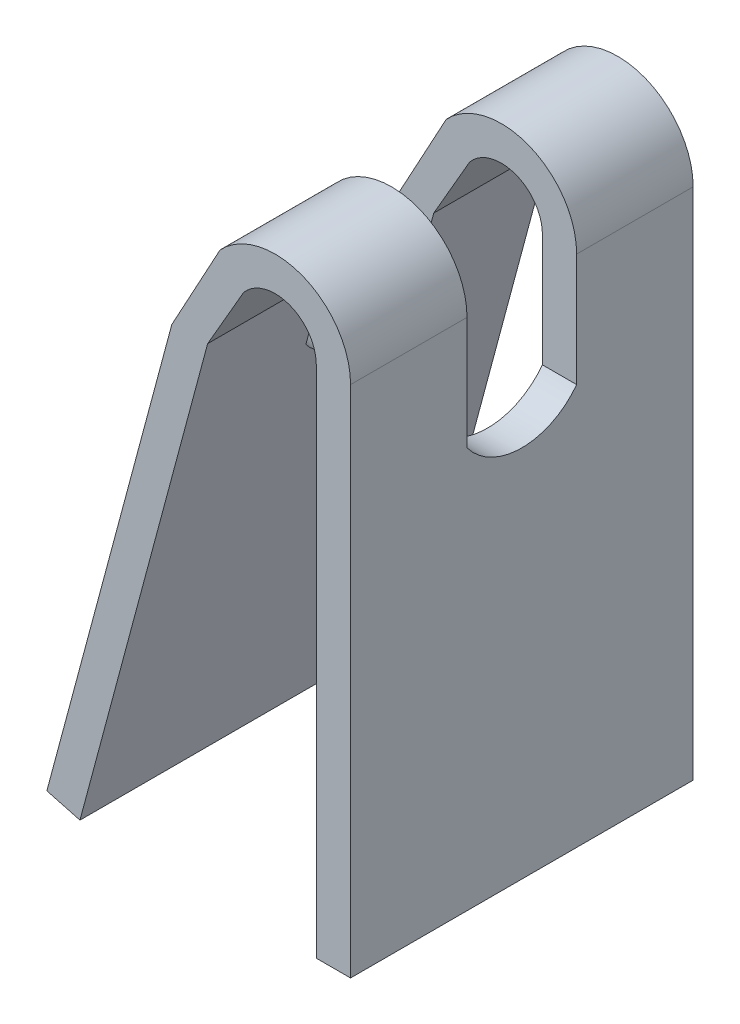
ISO-10303-21;
HEADER;
FILE_DESCRIPTION(('STEP AP214'),'2;1');
FILE_NAME('part.step','',(''),(''),'','','');
FILE_SCHEMA(('AUTOMOTIVE_DESIGN { 1 0 10303 214 1 1 1 1 }'));
ENDSEC;
DATA;
#1=APPLICATION_CONTEXT('core data for automotive mechanical design processes');
#2=APPLICATION_PROTOCOL_DEFINITION('international standard','automotive_design',2000,#1);
#3=PRODUCT_CONTEXT('',#1,'mechanical');
#4=PRODUCT('Part','Part','',(#3));
#5=PRODUCT_RELATED_PRODUCT_CATEGORY('part','',(#4));
#6=PRODUCT_DEFINITION_FORMATION('','',#4);
#7=PRODUCT_DEFINITION_CONTEXT('part definition',#1,'design');
#8=PRODUCT_DEFINITION('design','',#6,#7);
#9=PRODUCT_DEFINITION_SHAPE('','',#8);
#10=(LENGTH_UNIT() NAMED_UNIT(*) SI_UNIT(.MILLI.,.METRE.));
#11=(NAMED_UNIT(*) PLANE_ANGLE_UNIT() SI_UNIT($,.RADIAN.));
#12=(NAMED_UNIT(*) SI_UNIT($,.STERADIAN.) SOLID_ANGLE_UNIT());
#13=UNCERTAINTY_MEASURE_WITH_UNIT(LENGTH_MEASURE(1.E-05),#10,'distance_accuracy_value','');
#14=(GEOMETRIC_REPRESENTATION_CONTEXT(3) GLOBAL_UNCERTAINTY_ASSIGNED_CONTEXT((#13)) GLOBAL_UNIT_ASSIGNED_CONTEXT((#10,
#11,#12)) REPRESENTATION_CONTEXT('',''));
#15=CARTESIAN_POINT('',(0.,0.,0.));
#16=DIRECTION('',(0.,0.,1.));
#17=DIRECTION('',(1.,0.,0.));
#18=AXIS2_PLACEMENT_3D('',#15,#16,#17);
#19=CARTESIAN_POINT('',(-6.,75.,50.));
#20=DIRECTION('',(0.,0.,-1.));
#21=DIRECTION('',(-1.,0.,0.));
#22=AXIS2_PLACEMENT_3D('',#19,#20,#21);
#23=CYLINDRICAL_SURFACE('',#22,11.);
#24=DIRECTION('',(0.,0.,-1.));
#25=VECTOR('',#24,1.);
#26=CARTESIAN_POINT('',(-14.0426536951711,82.5043801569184,50.));
#27=LINE('',#26,#25);
#28=CARTESIAN_POINT('',(-14.0426536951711,82.5043801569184,17.));
#29=VERTEX_POINT('',#28);
#30=CARTESIAN_POINT('',(-14.0426536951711,82.5043801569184,0.));
#31=VERTEX_POINT('',#30);
#32=EDGE_CURVE('E303',#29,#31,#27,.T.);
#33=ORIENTED_EDGE('',*,*,#32,.F.);
#34=CARTESIAN_POINT('',(-6.,75.,17.));
#35=DIRECTION('',(0.,0.,-1.));
#36=DIRECTION('',(0.,1.,0.));
#37=AXIS2_PLACEMENT_3D('',#34,#35,#36);
#38=CIRCLE('',#37,11.);
#39=CARTESIAN_POINT('',(5.,75.,17.));
#40=VERTEX_POINT('',#39);
#41=EDGE_CURVE('E227',#29,#40,#38,.T.);
#42=ORIENTED_EDGE('',*,*,#41,.T.);
#43=DIRECTION('',(0.,0.,-1.));
#44=VECTOR('',#43,1.);
#45=CARTESIAN_POINT('',(5.,75.,50.));
#46=LINE('',#45,#44);
#47=CARTESIAN_POINT('',(5.,75.,0.));
#48=VERTEX_POINT('',#47);
#49=EDGE_CURVE('E307',#40,#48,#46,.T.);
#50=ORIENTED_EDGE('',*,*,#49,.T.);
#51=CARTESIAN_POINT('',(-6.,75.,0.));
#52=DIRECTION('',(0.,0.,1.));
#53=DIRECTION('',(1.,0.,0.));
#54=AXIS2_PLACEMENT_3D('',#51,#52,#53);
#55=CIRCLE('',#54,11.);
#56=EDGE_CURVE('E245',#48,#31,#55,.T.);
#57=ORIENTED_EDGE('',*,*,#56,.T.);
#58=EDGE_LOOP('',(#33,#42,#50,#57));
#59=FACE_BOUND('',#58,.T.);
#60=ADVANCED_FACE('F32',(#59),#23,.T.);
#61=CARTESIAN_POINT('',(-14.0426536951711,82.5043801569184,50.));
#62=DIRECTION('',(0.878429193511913,-0.477872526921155,0.));
#63=DIRECTION('',(0.477872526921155,0.878429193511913,0.));
#64=AXIS2_PLACEMENT_3D('',#61,#62,#63);
#65=PLANE('',#64);
#66=DIRECTION('',(0.,0.,-1.));
#67=VECTOR('',#66,1.);
#68=CARTESIAN_POINT('',(-21.0854278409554,69.5582950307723,50.));
#69=LINE('',#68,#67);
#70=CARTESIAN_POINT('',(-21.0854278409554,69.5582950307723,17.));
#71=VERTEX_POINT('',#70);
#72=CARTESIAN_POINT('',(-21.0854278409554,69.5582950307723,0.));
#73=VERTEX_POINT('',#72);
#74=EDGE_CURVE('E300',#71,#73,#69,.T.);
#75=ORIENTED_EDGE('',*,*,#74,.F.);
#76=DIRECTION('',(0.477872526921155,0.878429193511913,0.));
#77=VECTOR('',#76,1.);
#78=CARTESIAN_POINT('',(-14.0426536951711,82.5043801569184,17.));
#79=LINE('',#78,#77);
#80=EDGE_CURVE('E186',#71,#29,#79,.T.);
#81=ORIENTED_EDGE('',*,*,#80,.T.);
#82=ORIENTED_EDGE('',*,*,#32,.T.);
#83=DIRECTION('',(-0.477872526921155,-0.878429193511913,0.));
#84=VECTOR('',#83,1.);
#85=CARTESIAN_POINT('',(-14.0426536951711,82.5043801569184,0.));
#86=LINE('',#85,#84);
#87=EDGE_CURVE('E248',#31,#73,#86,.T.);
#88=ORIENTED_EDGE('',*,*,#87,.T.);
#89=EDGE_LOOP('',(#75,#81,#82,#88));
#90=FACE_BOUND('',#89,.T.);
#91=ADVANCED_FACE('F381',(#90),#65,.F.);
#92=CARTESIAN_POINT('',(-10.6077522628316,78.8429961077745,50.));
#93=DIRECTION('',(-0.866025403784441,0.499999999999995,0.));
#94=DIRECTION('',(-0.499999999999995,-0.866025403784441,0.));
#95=AXIS2_PLACEMENT_3D('',#92,#93,#94);
#96=PLANE('',#95);
#97=DIRECTION('',(0.,0.,-1.));
#98=VECTOR('',#97,1.);
#99=CARTESIAN_POINT('',(-10.6077522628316,78.8429961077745,50.));
#100=LINE('',#99,#98);
#101=CARTESIAN_POINT('',(-10.6077522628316,78.8429961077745,17.));
#102=VERTEX_POINT('',#101);
#103=CARTESIAN_POINT('',(-10.6077522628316,78.8429961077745,0.));
#104=VERTEX_POINT('',#103);
#105=EDGE_CURVE('E286',#102,#104,#100,.T.);
#106=ORIENTED_EDGE('',*,*,#105,.F.);
#107=DIRECTION('',(-0.499999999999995,-0.866025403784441,0.));
#108=VECTOR('',#107,1.);
#109=CARTESIAN_POINT('',(-10.6077522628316,78.8429961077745,17.));
#110=LINE('',#109,#108);
#111=CARTESIAN_POINT('',(-15.8577522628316,69.7497293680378,17.));
#112=VERTEX_POINT('',#111);
#113=EDGE_CURVE('E205',#102,#112,#110,.T.);
#114=ORIENTED_EDGE('',*,*,#113,.T.);
#115=DIRECTION('',(0.,0.,-1.));
#116=VECTOR('',#115,1.);
#117=CARTESIAN_POINT('',(-15.8577522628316,69.7497293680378,50.));
#118=LINE('',#117,#116);
#119=CARTESIAN_POINT('',(-15.8577522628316,69.7497293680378,0.));
#120=VERTEX_POINT('',#119);
#121=EDGE_CURVE('E290',#112,#120,#118,.T.);
#122=ORIENTED_EDGE('',*,*,#121,.T.);
#123=DIRECTION('',(0.499999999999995,0.866025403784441,0.));
#124=VECTOR('',#123,1.);
#125=CARTESIAN_POINT('',(-10.6077522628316,78.8429961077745,0.));
#126=LINE('',#125,#124);
#127=EDGE_CURVE('E258',#120,#104,#126,.T.);
#128=ORIENTED_EDGE('',*,*,#127,.T.);
#129=EDGE_LOOP('',(#106,#114,#122,#128));
#130=FACE_BOUND('',#129,.T.);
#131=ADVANCED_FACE('F364',(#130),#96,.F.);
#132=CARTESIAN_POINT('',(-6.,75.,50.));
#133=DIRECTION('',(0.,0.,-1.));
#134=DIRECTION('',(-1.,0.,0.));
#135=AXIS2_PLACEMENT_3D('',#132,#133,#134);
#136=CYLINDRICAL_SURFACE('',#135,6.);
#137=CARTESIAN_POINT('',(-6.,75.,17.));
#138=DIRECTION('',(0.,0.,-1.));
#139=DIRECTION('',(0.,1.,0.));
#140=AXIS2_PLACEMENT_3D('',#137,#138,#139);
#141=CIRCLE('',#140,6.);
#142=CARTESIAN_POINT('',(0.,75.,17.));
#143=VERTEX_POINT('',#142);
#144=EDGE_CURVE('E317',#143,#102,#141,.F.);
#145=ORIENTED_EDGE('',*,*,#144,.T.);
#146=ORIENTED_EDGE('',*,*,#105,.T.);
#147=CARTESIAN_POINT('',(-6.,75.,0.));
#148=DIRECTION('',(0.,0.,-1.));
#149=DIRECTION('',(1.,0.,0.));
#150=AXIS2_PLACEMENT_3D('',#147,#148,#149);
#151=CIRCLE('',#150,6.);
#152=CARTESIAN_POINT('',(0.,75.,0.));
#153=VERTEX_POINT('',#152);
#154=EDGE_CURVE('E261',#104,#153,#151,.T.);
#155=ORIENTED_EDGE('',*,*,#154,.T.);
#156=DIRECTION('',(0.,0.,-1.));
#157=VECTOR('',#156,1.);
#158=CARTESIAN_POINT('',(0.,75.,50.));
#159=LINE('',#158,#157);
#160=EDGE_CURVE('E282',#143,#153,#159,.T.);
#161=ORIENTED_EDGE('',*,*,#160,.F.);
#162=EDGE_LOOP('',(#145,#146,#155,#161));
#163=FACE_BOUND('',#162,.T.);
#164=ADVANCED_FACE('F368',(#163),#136,.F.);
#165=CARTESIAN_POINT('',(0.,0.,50.));
#166=DIRECTION('',(1.,0.,0.));
#167=DIRECTION('',(0.,0.,-1.));
#168=AXIS2_PLACEMENT_3D('',#165,#166,#167);
#169=PLANE('',#168);
#170=CARTESIAN_POINT('',(0.,75.,50.));
#171=VERTEX_POINT('',#170);
#172=CARTESIAN_POINT('',(0.,75.,33.));
#173=VERTEX_POINT('',#172);
#174=EDGE_CURVE('E283',#171,#173,#159,.T.);
#175=ORIENTED_EDGE('',*,*,#174,.T.);
#176=DIRECTION('',(0.,-1.,0.));
#177=VECTOR('',#176,1.);
#178=CARTESIAN_POINT('',(0.,0.,33.));
#179=LINE('',#178,#177);
#180=CARTESIAN_POINT('',(0.,58.5,33.));
#181=VERTEX_POINT('',#180);
#182=EDGE_CURVE('E229',#173,#181,#179,.T.);
#183=ORIENTED_EDGE('',*,*,#182,.T.);
#184=CARTESIAN_POINT('',(0.,64.5,25.));
#185=DIRECTION('',(1.,0.,0.));
#186=DIRECTION('',(0.,0.,-1.));
#187=AXIS2_PLACEMENT_3D('',#184,#185,#186);
#188=CIRCLE('',#187,10.);
#189=CARTESIAN_POINT('',(0.,58.5,17.));
#190=VERTEX_POINT('',#189);
#191=EDGE_CURVE('E234',#181,#190,#188,.T.);
#192=ORIENTED_EDGE('',*,*,#191,.T.);
#193=DIRECTION('',(0.,1.,0.));
#194=VECTOR('',#193,1.);
#195=CARTESIAN_POINT('',(0.,0.,17.));
#196=LINE('',#195,#194);
#197=EDGE_CURVE('E223',#190,#143,#196,.T.);
#198=ORIENTED_EDGE('',*,*,#197,.T.);
#199=ORIENTED_EDGE('',*,*,#160,.T.);
#200=DIRECTION('',(0.,-1.,0.));
#201=VECTOR('',#200,1.);
#202=CARTESIAN_POINT('',(0.,0.,0.));
#203=LINE('',#202,#201);
#204=CARTESIAN_POINT('',(0.,0.,0.));
#205=VERTEX_POINT('',#204);
#206=EDGE_CURVE('E237',#153,#205,#203,.T.);
#207=ORIENTED_EDGE('',*,*,#206,.T.);
#208=DIRECTION('',(0.,0.,-1.));
#209=VECTOR('',#208,1.);
#210=CARTESIAN_POINT('',(0.,0.,50.));
#211=LINE('',#210,#209);
#212=CARTESIAN_POINT('',(0.,0.,50.));
#213=VERTEX_POINT('',#212);
#214=EDGE_CURVE('E314',#213,#205,#211,.T.);
#215=ORIENTED_EDGE('',*,*,#214,.F.);
#216=DIRECTION('',(0.,-1.,0.));
#217=VECTOR('',#216,1.);
#218=CARTESIAN_POINT('',(0.,0.,50.));
#219=LINE('',#218,#217);
#220=EDGE_CURVE('E264',#171,#213,#219,.T.);
#221=ORIENTED_EDGE('',*,*,#220,.F.);
#222=EDGE_LOOP('',(#175,#183,#192,#198,#199,#207,#215,#221));
#223=FACE_BOUND('',#222,.T.);
#224=ADVANCED_FACE('F34',(#223),#169,.F.);
#225=CARTESIAN_POINT('',(0.,0.,50.));
#226=DIRECTION('',(0.,1.,0.));
#227=DIRECTION('',(0.,0.,1.));
#228=AXIS2_PLACEMENT_3D('',#225,#226,#227);
#229=PLANE('',#228);
#230=DIRECTION('',(1.,0.,0.));
#231=VECTOR('',#230,1.);
#232=CARTESIAN_POINT('',(0.,0.,0.));
#233=LINE('',#232,#231);
#234=CARTESIAN_POINT('',(5.,0.,0.));
#235=VERTEX_POINT('',#234);
#236=EDGE_CURVE('E240',#205,#235,#233,.T.);
#237=ORIENTED_EDGE('',*,*,#236,.T.);
#238=DIRECTION('',(0.,0.,-1.));
#239=VECTOR('',#238,1.);
#240=CARTESIAN_POINT('',(5.,0.,50.));
#241=LINE('',#240,#239);
#242=CARTESIAN_POINT('',(5.,0.,50.));
#243=VERTEX_POINT('',#242);
#244=EDGE_CURVE('E311',#243,#235,#241,.T.);
#245=ORIENTED_EDGE('',*,*,#244,.F.);
#246=DIRECTION('',(1.,0.,0.));
#247=VECTOR('',#246,1.);
#248=CARTESIAN_POINT('',(0.,0.,50.));
#249=LINE('',#248,#247);
#250=EDGE_CURVE('E266',#213,#243,#249,.T.);
#251=ORIENTED_EDGE('',*,*,#250,.F.);
#252=ORIENTED_EDGE('',*,*,#214,.T.);
#253=EDGE_LOOP('',(#237,#245,#251,#252));
#254=FACE_BOUND('',#253,.T.);
#255=ADVANCED_FACE('F333',(#254),#229,.F.);
#256=CARTESIAN_POINT('',(5.,0.,50.));
#257=DIRECTION('',(-1.,0.,0.));
#258=DIRECTION('',(0.,0.,1.));
#259=AXIS2_PLACEMENT_3D('',#256,#257,#258);
#260=PLANE('',#259);
#261=CARTESIAN_POINT('',(5.,64.5,25.));
#262=DIRECTION('',(1.,0.,0.));
#263=DIRECTION('',(0.,0.,-1.));
#264=AXIS2_PLACEMENT_3D('',#261,#262,#263);
#265=CIRCLE('',#264,10.);
#266=CARTESIAN_POINT('',(5.,58.5,33.));
#267=VERTEX_POINT('',#266);
#268=CARTESIAN_POINT('',(5.,58.5,17.));
#269=VERTEX_POINT('',#268);
#270=EDGE_CURVE('E214',#267,#269,#265,.T.);
#271=ORIENTED_EDGE('',*,*,#270,.F.);
#272=DIRECTION('',(0.,-1.,0.));
#273=VECTOR('',#272,1.);
#274=CARTESIAN_POINT('',(5.,90.0230183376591,33.));
#275=LINE('',#274,#273);
#276=CARTESIAN_POINT('',(5.,75.,33.));
#277=VERTEX_POINT('',#276);
#278=EDGE_CURVE('E211',#277,#267,#275,.T.);
#279=ORIENTED_EDGE('',*,*,#278,.F.);
#280=CARTESIAN_POINT('',(5.,75.,50.));
#281=VERTEX_POINT('',#280);
#282=EDGE_CURVE('E308',#281,#277,#46,.T.);
#283=ORIENTED_EDGE('',*,*,#282,.F.);
#284=DIRECTION('',(0.,1.,0.));
#285=VECTOR('',#284,1.);
#286=CARTESIAN_POINT('',(5.,0.,50.));
#287=LINE('',#286,#285);
#288=EDGE_CURVE('E268',#243,#281,#287,.T.);
#289=ORIENTED_EDGE('',*,*,#288,.F.);
#290=ORIENTED_EDGE('',*,*,#244,.T.);
#291=DIRECTION('',(0.,1.,0.));
#292=VECTOR('',#291,1.);
#293=CARTESIAN_POINT('',(5.,0.,0.));
#294=LINE('',#293,#292);
#295=EDGE_CURVE('E242',#235,#48,#294,.T.);
#296=ORIENTED_EDGE('',*,*,#295,.T.);
#297=ORIENTED_EDGE('',*,*,#49,.F.);
#298=DIRECTION('',(0.,1.,0.));
#299=VECTOR('',#298,1.);
#300=CARTESIAN_POINT('',(5.,90.0230183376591,17.));
#301=LINE('',#300,#299);
#302=EDGE_CURVE('E217',#269,#40,#301,.T.);
#303=ORIENTED_EDGE('',*,*,#302,.F.);
#304=EDGE_LOOP('',(#271,#279,#283,#289,#290,#296,#297,#303));
#305=FACE_BOUND('',#304,.T.);
#306=ADVANCED_FACE('F337',(#305),#260,.F.);
#307=CARTESIAN_POINT('',(-6.,75.,33.));
#308=DIRECTION('',(0.,0.,1.));
#309=DIRECTION('',(1.,0.,0.));
#310=AXIS2_PLACEMENT_3D('',#307,#308,#309);
#311=CIRCLE('',#310,11.);
#312=CARTESIAN_POINT('',(-14.0426536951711,82.5043801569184,33.));
#313=VERTEX_POINT('',#312);
#314=EDGE_CURVE('E232',#277,#313,#311,.T.);
#315=ORIENTED_EDGE('',*,*,#314,.T.);
#316=CARTESIAN_POINT('',(-14.0426536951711,82.5043801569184,50.));
#317=VERTEX_POINT('',#316);
#318=EDGE_CURVE('E304',#317,#313,#27,.T.);
#319=ORIENTED_EDGE('',*,*,#318,.F.);
#320=CARTESIAN_POINT('',(-6.,75.,50.));
#321=DIRECTION('',(0.,0.,1.));
#322=DIRECTION('',(1.,0.,0.));
#323=AXIS2_PLACEMENT_3D('',#320,#321,#322);
#324=CIRCLE('',#323,11.);
#325=EDGE_CURVE('E270',#281,#317,#324,.T.);
#326=ORIENTED_EDGE('',*,*,#325,.F.);
#327=ORIENTED_EDGE('',*,*,#282,.T.);
#328=EDGE_LOOP('',(#315,#319,#326,#327));
#329=FACE_BOUND('',#328,.T.);
#330=ADVANCED_FACE('F342',(#329),#23,.T.);
#331=ORIENTED_EDGE('',*,*,#318,.T.);
#332=DIRECTION('',(-0.477872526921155,-0.878429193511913,0.));
#333=VECTOR('',#332,1.);
#334=CARTESIAN_POINT('',(-14.0426536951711,82.5043801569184,33.));
#335=LINE('',#334,#333);
#336=CARTESIAN_POINT('',(-21.0854278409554,69.5582950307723,33.));
#337=VERTEX_POINT('',#336);
#338=EDGE_CURVE('E195',#313,#337,#335,.T.);
#339=ORIENTED_EDGE('',*,*,#338,.T.);
#340=CARTESIAN_POINT('',(-21.0854278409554,69.5582950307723,50.));
#341=VERTEX_POINT('',#340);
#342=EDGE_CURVE('E301',#341,#337,#69,.T.);
#343=ORIENTED_EDGE('',*,*,#342,.F.);
#344=DIRECTION('',(-0.477872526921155,-0.878429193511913,0.));
#345=VECTOR('',#344,1.);
#346=CARTESIAN_POINT('',(-14.0426536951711,82.5043801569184,50.));
#347=LINE('',#346,#345);
#348=EDGE_CURVE('E272',#317,#341,#347,.T.);
#349=ORIENTED_EDGE('',*,*,#348,.F.);
#350=EDGE_LOOP('',(#331,#339,#343,#349));
#351=FACE_BOUND('',#350,.T.);
#352=ADVANCED_FACE('F348',(#351),#65,.F.);
#353=CARTESIAN_POINT('',(-39.322352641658,1.49716510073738,50.));
#354=DIRECTION('',(0.965925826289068,-0.258819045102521,0.));
#355=DIRECTION('',(0.258819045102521,0.965925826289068,0.));
#356=AXIS2_PLACEMENT_3D('',#353,#354,#355);
#357=PLANE('',#356);
#358=CARTESIAN_POINT('',(-21.7922220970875,66.9205029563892,25.));
#359=DIRECTION('',(-0.965925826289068,0.258819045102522,0.));
#360=DIRECTION('',(-0.258819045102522,-0.965925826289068,0.));
#361=AXIS2_PLACEMENT_3D('',#358,#359,#360);
#362=CIRCLE('',#361,10.);
#363=CARTESIAN_POINT('',(-23.3451363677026,61.1249479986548,17.));
#364=VERTEX_POINT('',#363);
#365=CARTESIAN_POINT('',(-23.3451363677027,61.1249479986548,33.));
#366=VERTEX_POINT('',#365);
#367=EDGE_CURVE('E174',#364,#366,#362,.T.);
#368=ORIENTED_EDGE('',*,*,#367,.F.);
#369=DIRECTION('',(-0.258819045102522,-0.965925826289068,0.));
#370=VECTOR('',#369,1.);
#371=CARTESIAN_POINT('',(-14.7437947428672,93.2255919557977,17.));
#372=LINE('',#371,#370);
#373=EDGE_CURVE('E182',#71,#364,#372,.T.);
#374=ORIENTED_EDGE('',*,*,#373,.F.);
#375=ORIENTED_EDGE('',*,*,#74,.T.);
#376=DIRECTION('',(-0.258819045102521,-0.965925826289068,0.));
#377=VECTOR('',#376,1.);
#378=CARTESIAN_POINT('',(-39.322352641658,1.49716510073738,0.));
#379=LINE('',#378,#377);
#380=CARTESIAN_POINT('',(-39.322352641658,1.49716510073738,0.));
#381=VERTEX_POINT('',#380);
#382=EDGE_CURVE('E251',#73,#381,#379,.T.);
#383=ORIENTED_EDGE('',*,*,#382,.T.);
#384=DIRECTION('',(0.,0.,-1.));
#385=VECTOR('',#384,1.);
#386=CARTESIAN_POINT('',(-39.322352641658,1.49716510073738,50.));
#387=LINE('',#386,#385);
#388=CARTESIAN_POINT('',(-39.322352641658,1.49716510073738,50.));
#389=VERTEX_POINT('',#388);
#390=EDGE_CURVE('E297',#389,#381,#387,.T.);
#391=ORIENTED_EDGE('',*,*,#390,.F.);
#392=DIRECTION('',(-0.258819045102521,-0.965925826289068,0.));
#393=VECTOR('',#392,1.);
#394=CARTESIAN_POINT('',(-39.322352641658,1.49716510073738,50.));
#395=LINE('',#394,#393);
#396=EDGE_CURVE('E274',#341,#389,#395,.T.);
#397=ORIENTED_EDGE('',*,*,#396,.F.);
#398=ORIENTED_EDGE('',*,*,#342,.T.);
#399=DIRECTION('',(0.258819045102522,0.965925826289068,0.));
#400=VECTOR('',#399,1.);
#401=CARTESIAN_POINT('',(-14.7437947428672,93.2255919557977,33.));
#402=LINE('',#401,#400);
#403=EDGE_CURVE('E179',#366,#337,#402,.T.);
#404=ORIENTED_EDGE('',*,*,#403,.F.);
#405=EDGE_LOOP('',(#368,#374,#375,#383,#391,#397,#398,#404));
#406=FACE_BOUND('',#405,.T.);
#407=ADVANCED_FACE('F190',(#406),#357,.F.);
#408=CARTESIAN_POINT('',(-34.4927235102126,0.203069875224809,50.));
#409=DIRECTION('',(0.258819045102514,0.96592582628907,0.));
#410=DIRECTION('',(-0.96592582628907,0.258819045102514,0.));
#411=AXIS2_PLACEMENT_3D('',#408,#409,#410);
#412=PLANE('',#411);
#413=DIRECTION('',(0.96592582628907,-0.258819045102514,0.));
#414=VECTOR('',#413,1.);
#415=CARTESIAN_POINT('',(-34.4927235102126,0.203069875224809,0.));
#416=LINE('',#415,#414);
#417=CARTESIAN_POINT('',(-34.4927235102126,0.203069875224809,0.));
#418=VERTEX_POINT('',#417);
#419=EDGE_CURVE('E253',#381,#418,#416,.T.);
#420=ORIENTED_EDGE('',*,*,#419,.T.);
#421=DIRECTION('',(0.,0.,-1.));
#422=VECTOR('',#421,1.);
#423=CARTESIAN_POINT('',(-34.4927235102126,0.203069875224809,50.));
#424=LINE('',#423,#422);
#425=CARTESIAN_POINT('',(-34.4927235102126,0.203069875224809,50.));
#426=VERTEX_POINT('',#425);
#427=EDGE_CURVE('E294',#426,#418,#424,.T.);
#428=ORIENTED_EDGE('',*,*,#427,.F.);
#429=DIRECTION('',(0.96592582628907,-0.258819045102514,0.));
#430=VECTOR('',#429,1.);
#431=CARTESIAN_POINT('',(-34.4927235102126,0.203069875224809,50.));
#432=LINE('',#431,#430);
#433=EDGE_CURVE('E276',#389,#426,#432,.T.);
#434=ORIENTED_EDGE('',*,*,#433,.F.);
#435=ORIENTED_EDGE('',*,*,#390,.T.);
#436=EDGE_LOOP('',(#420,#428,#434,#435));
#437=FACE_BOUND('',#436,.T.);
#438=ADVANCED_FACE('F354',(#437),#412,.F.);
#439=CARTESIAN_POINT('',(-15.8577522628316,69.7497293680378,50.));
#440=DIRECTION('',(-0.96592582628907,0.258819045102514,0.));
#441=DIRECTION('',(-0.258819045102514,-0.96592582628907,0.));
#442=AXIS2_PLACEMENT_3D('',#439,#440,#441);
#443=PLANE('',#442);
#444=ORIENTED_EDGE('',*,*,#121,.F.);
#445=DIRECTION('',(-0.258819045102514,-0.96592582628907,0.));
#446=VECTOR('',#445,1.);
#447=CARTESIAN_POINT('',(-15.8577522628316,69.7497293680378,17.));
#448=LINE('',#447,#446);
#449=CARTESIAN_POINT('',(-18.5155072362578,59.8308527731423,17.));
#450=VERTEX_POINT('',#449);
#451=EDGE_CURVE('E208',#112,#450,#448,.T.);
#452=ORIENTED_EDGE('',*,*,#451,.T.);
#453=CARTESIAN_POINT('',(-16.9625929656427,65.6264077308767,25.));
#454=DIRECTION('',(-0.96592582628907,0.258819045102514,0.));
#455=DIRECTION('',(-0.258819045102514,-0.96592582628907,0.));
#456=AXIS2_PLACEMENT_3D('',#453,#454,#455);
#457=CIRCLE('',#456,10.);
#458=CARTESIAN_POINT('',(-18.5155072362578,59.8308527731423,33.));
#459=VERTEX_POINT('',#458);
#460=EDGE_CURVE('E11',#450,#459,#457,.T.);
#461=ORIENTED_EDGE('',*,*,#460,.T.);
#462=DIRECTION('',(0.258819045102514,0.96592582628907,0.));
#463=VECTOR('',#462,1.);
#464=CARTESIAN_POINT('',(-15.8577522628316,69.7497293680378,33.));
#465=LINE('',#464,#463);
#466=CARTESIAN_POINT('',(-15.8577522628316,69.7497293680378,33.));
#467=VERTEX_POINT('',#466);
#468=EDGE_CURVE('E202',#459,#467,#465,.T.);
#469=ORIENTED_EDGE('',*,*,#468,.T.);
#470=CARTESIAN_POINT('',(-15.8577522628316,69.7497293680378,50.));
#471=VERTEX_POINT('',#470);
#472=EDGE_CURVE('E291',#471,#467,#118,.T.);
#473=ORIENTED_EDGE('',*,*,#472,.F.);
#474=DIRECTION('',(0.258819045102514,0.96592582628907,0.));
#475=VECTOR('',#474,1.);
#476=CARTESIAN_POINT('',(-15.8577522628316,69.7497293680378,50.));
#477=LINE('',#476,#475);
#478=EDGE_CURVE('E278',#426,#471,#477,.T.);
#479=ORIENTED_EDGE('',*,*,#478,.F.);
#480=ORIENTED_EDGE('',*,*,#427,.T.);
#481=DIRECTION('',(0.258819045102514,0.96592582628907,0.));
#482=VECTOR('',#481,1.);
#483=CARTESIAN_POINT('',(-15.8577522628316,69.7497293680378,0.));
#484=LINE('',#483,#482);
#485=EDGE_CURVE('E255',#418,#120,#484,.T.);
#486=ORIENTED_EDGE('',*,*,#485,.T.);
#487=EDGE_LOOP('',(#444,#452,#461,#469,#473,#479,#480,#486));
#488=FACE_BOUND('',#487,.T.);
#489=ADVANCED_FACE('F359',(#488),#443,.F.);
#490=ORIENTED_EDGE('',*,*,#472,.T.);
#491=DIRECTION('',(0.499999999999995,0.866025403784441,0.));
#492=VECTOR('',#491,1.);
#493=CARTESIAN_POINT('',(-10.6077522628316,78.8429961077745,33.));
#494=LINE('',#493,#492);
#495=CARTESIAN_POINT('',(-10.6077522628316,78.8429961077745,33.));
#496=VERTEX_POINT('',#495);
#497=EDGE_CURVE('E199',#467,#496,#494,.T.);
#498=ORIENTED_EDGE('',*,*,#497,.T.);
#499=CARTESIAN_POINT('',(-10.6077522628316,78.8429961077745,50.));
#500=VERTEX_POINT('',#499);
#501=EDGE_CURVE('E287',#500,#496,#100,.T.);
#502=ORIENTED_EDGE('',*,*,#501,.F.);
#503=DIRECTION('',(0.499999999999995,0.866025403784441,0.));
#504=VECTOR('',#503,1.);
#505=CARTESIAN_POINT('',(-10.6077522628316,78.8429961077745,50.));
#506=LINE('',#505,#504);
#507=EDGE_CURVE('E52',#471,#500,#506,.T.);
#508=ORIENTED_EDGE('',*,*,#507,.F.);
#509=EDGE_LOOP('',(#490,#498,#502,#508));
#510=FACE_BOUND('',#509,.T.);
#511=ADVANCED_FACE('F361',(#510),#96,.F.);
#512=ORIENTED_EDGE('',*,*,#501,.T.);
#513=CARTESIAN_POINT('',(-6.,75.,33.));
#514=DIRECTION('',(0.,0.,1.));
#515=DIRECTION('',(1.,0.,0.));
#516=AXIS2_PLACEMENT_3D('',#513,#514,#515);
#517=CIRCLE('',#516,6.);
#518=EDGE_CURVE('E40',#496,#173,#517,.F.);
#519=ORIENTED_EDGE('',*,*,#518,.T.);
#520=ORIENTED_EDGE('',*,*,#174,.F.);
#521=CARTESIAN_POINT('',(-6.,75.,50.));
#522=DIRECTION('',(0.,0.,-1.));
#523=DIRECTION('',(1.,0.,0.));
#524=AXIS2_PLACEMENT_3D('',#521,#522,#523);
#525=CIRCLE('',#524,6.);
#526=EDGE_CURVE('E47',#500,#171,#525,.T.);
#527=ORIENTED_EDGE('',*,*,#526,.F.);
#528=EDGE_LOOP('',(#512,#519,#520,#527));
#529=FACE_BOUND('',#528,.T.);
#530=ADVANCED_FACE('F320',(#529),#136,.F.);
#531=CARTESIAN_POINT('',(-6.,75.,50.));
#532=DIRECTION('',(0.,0.,1.));
#533=DIRECTION('',(1.,0.,0.));
#534=AXIS2_PLACEMENT_3D('',#531,#532,#533);
#535=PLANE('',#534);
#536=ORIENTED_EDGE('',*,*,#220,.T.);
#537=ORIENTED_EDGE('',*,*,#250,.T.);
#538=ORIENTED_EDGE('',*,*,#288,.T.);
#539=ORIENTED_EDGE('',*,*,#325,.T.);
#540=ORIENTED_EDGE('',*,*,#348,.T.);
#541=ORIENTED_EDGE('',*,*,#396,.T.);
#542=ORIENTED_EDGE('',*,*,#433,.T.);
#543=ORIENTED_EDGE('',*,*,#478,.T.);
#544=ORIENTED_EDGE('',*,*,#507,.T.);
#545=ORIENTED_EDGE('',*,*,#526,.T.);
#546=EDGE_LOOP('',(#536,#537,#538,#539,#540,#541,#542,#543,#544,#545));
#547=FACE_BOUND('',#546,.T.);
#548=ADVANCED_FACE('F328',(#547),#535,.T.);
#549=CARTESIAN_POINT('',(-6.,75.,0.));
#550=DIRECTION('',(0.,0.,1.));
#551=DIRECTION('',(1.,0.,0.));
#552=AXIS2_PLACEMENT_3D('',#549,#550,#551);
#553=PLANE('',#552);
#554=ORIENTED_EDGE('',*,*,#206,.F.);
#555=ORIENTED_EDGE('',*,*,#154,.F.);
#556=ORIENTED_EDGE('',*,*,#127,.F.);
#557=ORIENTED_EDGE('',*,*,#485,.F.);
#558=ORIENTED_EDGE('',*,*,#419,.F.);
#559=ORIENTED_EDGE('',*,*,#382,.F.);
#560=ORIENTED_EDGE('',*,*,#87,.F.);
#561=ORIENTED_EDGE('',*,*,#56,.F.);
#562=ORIENTED_EDGE('',*,*,#295,.F.);
#563=ORIENTED_EDGE('',*,*,#236,.F.);
#564=EDGE_LOOP('',(#554,#555,#556,#557,#558,#559,#560,#561,#562,#563));
#565=FACE_BOUND('',#564,.T.);
#566=ADVANCED_FACE('F383',(#565),#553,.F.);
#567=CARTESIAN_POINT('',(-5.,64.5,25.));
#568=DIRECTION('',(1.,0.,0.));
#569=DIRECTION('',(0.,0.,-1.));
#570=AXIS2_PLACEMENT_3D('',#567,#568,#569);
#571=CYLINDRICAL_SURFACE('',#570,10.);
#572=DIRECTION('',(1.,0.,0.));
#573=VECTOR('',#572,1.);
#574=CARTESIAN_POINT('',(-5.,58.5,33.));
#575=LINE('',#574,#573);
#576=EDGE_CURVE('E220',#181,#267,#575,.T.);
#577=ORIENTED_EDGE('',*,*,#576,.T.);
#578=ORIENTED_EDGE('',*,*,#270,.T.);
#579=DIRECTION('',(1.,0.,0.));
#580=VECTOR('',#579,1.);
#581=CARTESIAN_POINT('',(-5.,58.5,17.));
#582=LINE('',#581,#580);
#583=EDGE_CURVE('E221',#190,#269,#582,.T.);
#584=ORIENTED_EDGE('',*,*,#583,.F.);
#585=ORIENTED_EDGE('',*,*,#191,.F.);
#586=EDGE_LOOP('',(#577,#578,#584,#585));
#587=FACE_BOUND('',#586,.T.);
#588=ADVANCED_FACE('F373',(#587),#571,.F.);
#589=CARTESIAN_POINT('',(-5.,90.0230183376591,33.));
#590=DIRECTION('',(0.,0.,1.));
#591=DIRECTION('',(1.,0.,0.));
#592=AXIS2_PLACEMENT_3D('',#589,#590,#591);
#593=PLANE('',#592);
#594=ORIENTED_EDGE('',*,*,#338,.F.);
#595=ORIENTED_EDGE('',*,*,#314,.F.);
#596=ORIENTED_EDGE('',*,*,#278,.T.);
#597=ORIENTED_EDGE('',*,*,#576,.F.);
#598=ORIENTED_EDGE('',*,*,#182,.F.);
#599=ORIENTED_EDGE('',*,*,#518,.F.);
#600=ORIENTED_EDGE('',*,*,#497,.F.);
#601=ORIENTED_EDGE('',*,*,#468,.F.);
#602=DIRECTION('',(-0.965925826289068,0.258819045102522,0.));
#603=VECTOR('',#602,1.);
#604=CARTESIAN_POINT('',(-8.85624897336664,57.242662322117,33.));
#605=LINE('',#604,#603);
#606=EDGE_CURVE('E178',#459,#366,#605,.T.);
#607=ORIENTED_EDGE('',*,*,#606,.T.);
#608=ORIENTED_EDGE('',*,*,#403,.T.);
#609=EDGE_LOOP('',(#594,#595,#596,#597,#598,#599,#600,#601,#607,#608));
#610=FACE_BOUND('',#609,.T.);
#611=ADVANCED_FACE('F325',(#610),#593,.F.);
#612=CARTESIAN_POINT('',(-5.,90.0230183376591,17.));
#613=DIRECTION('',(0.,0.,-1.));
#614=DIRECTION('',(0.,1.,0.));
#615=AXIS2_PLACEMENT_3D('',#612,#613,#614);
#616=PLANE('',#615);
#617=ORIENTED_EDGE('',*,*,#113,.F.);
#618=ORIENTED_EDGE('',*,*,#144,.F.);
#619=ORIENTED_EDGE('',*,*,#197,.F.);
#620=ORIENTED_EDGE('',*,*,#583,.T.);
#621=ORIENTED_EDGE('',*,*,#302,.T.);
#622=ORIENTED_EDGE('',*,*,#41,.F.);
#623=ORIENTED_EDGE('',*,*,#80,.F.);
#624=ORIENTED_EDGE('',*,*,#373,.T.);
#625=DIRECTION('',(-0.965925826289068,0.258819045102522,0.));
#626=VECTOR('',#625,1.);
#627=CARTESIAN_POINT('',(-8.85624897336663,57.242662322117,17.));
#628=LINE('',#627,#626);
#629=EDGE_CURVE('E169',#450,#364,#628,.T.);
#630=ORIENTED_EDGE('',*,*,#629,.F.);
#631=ORIENTED_EDGE('',*,*,#451,.F.);
#632=EDGE_LOOP('',(#617,#618,#619,#620,#621,#622,#623,#624,#630,#631));
#633=FACE_BOUND('',#632,.T.);
#634=ADVANCED_FACE('F184',(#633),#616,.F.);
#635=CARTESIAN_POINT('',(-7.3033347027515,63.0382172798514,25.));
#636=DIRECTION('',(-0.965925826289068,0.258819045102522,0.));
#637=DIRECTION('',(-0.258819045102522,-0.965925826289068,0.));
#638=AXIS2_PLACEMENT_3D('',#635,#636,#637);
#639=CYLINDRICAL_SURFACE('',#638,10.);
#640=ORIENTED_EDGE('',*,*,#629,.T.);
#641=ORIENTED_EDGE('',*,*,#367,.T.);
#642=ORIENTED_EDGE('',*,*,#606,.F.);
#643=ORIENTED_EDGE('',*,*,#460,.F.);
#644=EDGE_LOOP('',(#640,#641,#642,#643));
#645=FACE_BOUND('',#644,.T.);
#646=ADVANCED_FACE('F171',(#645),#639,.F.);
#647=CLOSED_SHELL('',(#60,#91,#131,#164,#224,#255,#306,#330,#352,#407,#438,#489,#511,#530,#548,
#566,#588,#611,#634,#646));
#648=MANIFOLD_SOLID_BREP('B2',#647);
#649=ADVANCED_BREP_SHAPE_REPRESENTATION('',(#18,#648),#14);
#650=SHAPE_DEFINITION_REPRESENTATION(#9,#649);
ENDSEC;
END-ISO-10303-21;
